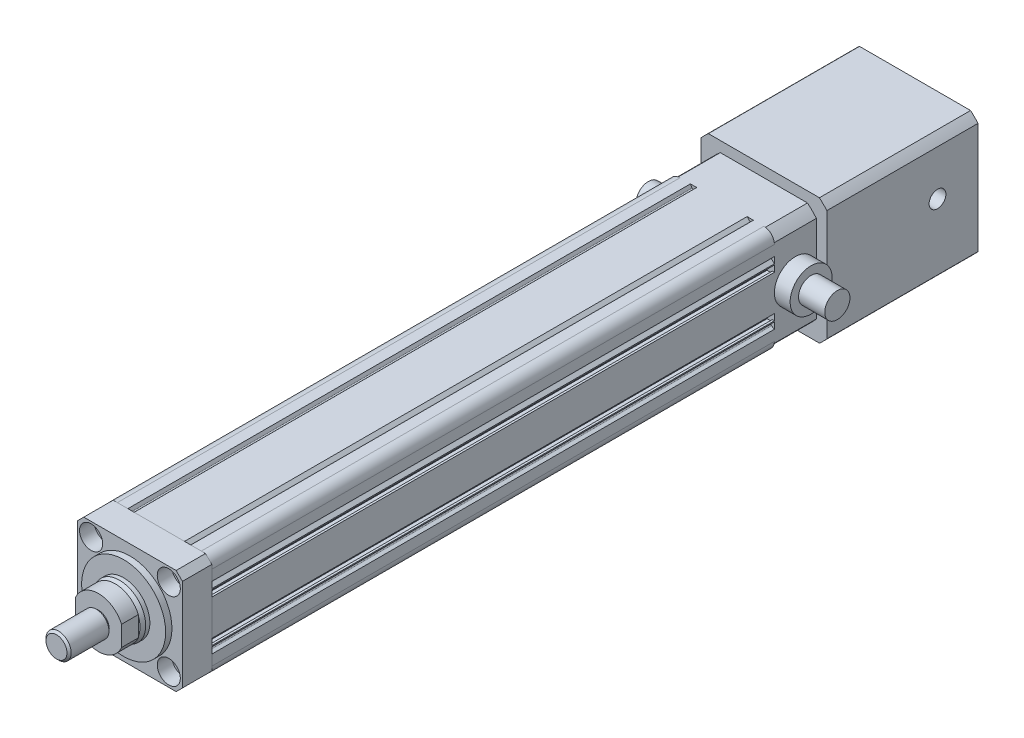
from build123d import *

# Parameters (mm, degrees)
SKETCH_1_R                  = 20
SKETCH_1_R_2                = 2.75
EXTRUDE_1_DEPTH             = 268
FILLET_1_R                  = 5
EXTRUDE_2_DEPTH             = 14
SKETCH_3_R                  = 20
EXTRUDE_3_DEPTH             = 3
SKETCH_5_R                  = 12.5
EXTRUDE_4_DEPTH             = 4
CHAMFER_1_SIZE              = 2
CHAMFER_1_SIZE2             = 0.7
EXTRUDE_5_DEPTH             = 8
SKETCH_7_R                  = 5.15
EXTRUDE_6_DEPTH             = 1
SKETCH_8_R                  = 6
EXTRUDE_7_DEPTH             = 19
CHAMFER_2_SIZE              = 1
SKETCH_23_W                 = 50
SKETCH_23_H                 = 50
EXTRUDE_8_DEPTH             = 20
SKETCH_24_R                 = 42.5
SKETCH_24_R_2               = 32.5
CUT_EXTRUDE_1_DEPTH         = 20
SKETCH_28_W                 = 60
SKETCH_28_H                 = 60
EXTRUDE_9_DEPTH             = 72
SKETCH_4_R                  = 3.5
CUT_EXTRUDE_5_DEPTH         = 30
SKETCH_4_6_R                = 5.5
CUT_EXTRUDE_6_DEPTH         = 7
CUT_EXTRUDE_START           = -72
SKETCH_30_R                 = 3.5
CUT_EXTRUDE_7_DEPTH         = 72
SKETCH_30_4_R               = 5.5
CUT_EXTRUDE_8_DEPTH         = 50
HOLE_WIZARD_M5_1_AT_2_COUNT = 2
HOLE_WIZARD_M5_1_AT_2_PITCH = 49.497474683
HOLE_WIZARD_M5_1_AT_3_COUNT = 2
HOLE_WIZARD_M5_1_AT_3_PITCH = 70
HOLE_WIZARD_M5_1_AT_4_COUNT = 2
HOLE_WIZARD_M5_1_AT_4_PITCH = 49.497474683
SKETCH_33_R                 = 19
CUT_EXTRUDE_9_DEPTH         = 65
SKETCH_33_3_R               = 25
CUT_EXTRUDE_10_DEPTH        = 6.5
SKETCH_34_R                 = 50
SKETCH_34_R_2               = 40
CUT_EXTRUDE_2_DEPTH         = 72
SKETCH_35_R                 = 4
CUT_EXTRUDE_11_DEPTH        = 22
SKETCH_36_R                 = 4
CUT_EXTRUDE_12_DEPTH        = 22
SKETCH_37_R                 = 6
EXTRUDE_10_DEPTH            = 20
EXTRUDE_START               = -70
SKETCH_37_2_R               = 6
EXTRUDE_11_DEPTH            = 20
SKETCH_38_R                 = 10
SKETCH_38_R_2               = 6
EXTRUDE_13_DEPTH            = 7.5
EXTRUDE_START_2             = -50
SKETCH_38_3_R               = 10
SKETCH_38_3_R_2             = 6
EXTRUDE_16_DEPTH            = 7.5


with BuildPart() as part:
    # Sketch 1 → Extrude 1 (new body)
    with BuildSketch(Plane.XY):
        with BuildLine():
            Line((-25, 25), (-15, 25))
            Line((-15, 25), (-14.227730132, 23.662389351))
            ThreePointArc((-14.227730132, 23.662389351), (-13.859980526, 23.416666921), (-13.441164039, 23.558835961))
            Line((-13.441164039, 23.558835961), (-12, 25))
            Line((-12, 25), (12, 25))
            Line((12, 25), (13.441164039, 23.558835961))
            ThreePointArc((13.441164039, 23.558835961), (13.859980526, 23.416666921), (14.227730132, 23.662389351))
            Line((14.227730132, 23.662389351), (15, 25))
            Line((15, 25), (25, 25))
            Line((25, 25), (25, 15))
            Line((25, 15), (23.662389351, 14.227730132))
            ThreePointArc((23.662389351, 14.227730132), (23.416666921, 13.859980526), (23.558835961, 13.441164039))
            Line((23.558835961, 13.441164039), (25, 12))
            Line((25, 12), (25, 11.5))
            Line((25, 11.5), (24, 11.5))
            Line((24, 11.5), (24, 12.4))
            Line((24, 12.4), (21.5, 12.4))
            Line((21.5, 12.4), (21.5, 7.6))
            Line((21.5, 7.6), (24, 7.6))
            Line((24, 7.6), (24, 8.5))
            Line((24, 8.5), (25, 8.5))
            Line((25, 8.5), (25, -8.5))
            Line((25, -8.5), (24, -8.5))
            Line((24, -8.5), (24, -7.6))
            Line((24, -7.6), (21.5, -7.6))
            Line((21.5, -7.6), (21.5, -12.4))
            Line((21.5, -12.4), (24, -12.4))
            Line((24, -12.4), (24, -11.5))
            Line((24, -11.5), (25, -11.5))
            Line((25, -11.5), (25, -12))
            Line((25, -12), (23.558835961, -13.441164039))
            ThreePointArc((23.558835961, -13.441164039), (23.416666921, -13.859980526), (23.662389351, -14.227730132))
            Line((23.662389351, -14.227730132), (25, -15))
            Line((25, -15), (25, -25))
            Line((25, -25), (15, -25))
            Line((15, -25), (14.227730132, -23.662389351))
            ThreePointArc((14.227730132, -23.662389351), (13.859980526, -23.416666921), (13.441164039, -23.558835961))
            Line((13.441164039, -23.558835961), (12, -25))
            Line((12, -25), (11.5, -25))
            Line((11.5, -25), (11.5, -24))
            Line((11.5, -24), (12.4, -24))
            Line((12.4, -24), (12.4, -21.5))
            Line((12.4, -21.5), (7.6, -21.5))
            Line((7.6, -21.5), (7.6, -24))
            Line((7.6, -24), (8.5, -24))
            Line((8.5, -24), (8.5, -25))
            Line((8.5, -25), (-8.5, -25))
            Line((-8.5, -25), (-8.5, -24))
            Line((-8.5, -24), (-7.6, -24))
            Line((-7.6, -24), (-7.6, -21.5))
            Line((-7.6, -21.5), (-12.4, -21.5))
            Line((-12.4, -21.5), (-12.4, -24))
            Line((-12.4, -24), (-11.5, -24))
            Line((-11.5, -24), (-11.5, -25))
            Line((-11.5, -25), (-12, -25))
            Line((-12, -25), (-13.441164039, -23.558835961))
            ThreePointArc((-13.441164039, -23.558835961), (-13.859980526, -23.416666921), (-14.227730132, -23.662389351))
            Line((-14.227730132, -23.662389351), (-15, -25))
            Line((-15, -25), (-25, -25))
            Line((-25, -25), (-25, -15))
            Line((-25, -15), (-23.662389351, -14.227730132))
            ThreePointArc((-23.662389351, -14.227730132), (-23.416666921, -13.859980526), (-23.558835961, -13.441164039))
            Line((-23.558835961, -13.441164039), (-25, -12))
            Line((-25, -12), (-25, -11.5))
            Line((-25, -11.5), (-24, -11.5))
            Line((-24, -11.5), (-24, -12.4))
            Line((-24, -12.4), (-21.5, -12.4))
            Line((-21.5, -12.4), (-21.5, -7.6))
            Line((-21.5, -7.6), (-24, -7.6))
            Line((-24, -7.6), (-24, -8.5))
            Line((-24, -8.5), (-25, -8.5))
            Line((-25, -8.5), (-25, 8.5))
            Line((-25, 8.5), (-24, 8.5))
            Line((-24, 8.5), (-24, 7.6))
            Line((-24, 7.6), (-21.5, 7.6))
            Line((-21.5, 7.6), (-21.5, 12.4))
            Line((-21.5, 12.4), (-24, 12.4))
            Line((-24, 12.4), (-24, 11.5))
            Line((-24, 11.5), (-25, 11.5))
            Line((-25, 11.5), (-25, 12))
            Line((-25, 12), (-23.558835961, 13.441164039))
            ThreePointArc((-23.558835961, 13.441164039), (-23.416666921, 13.859980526), (-23.662389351, 14.227730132))
            Line((-23.662389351, 14.227730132), (-25, 15))
            Line((-25, 15), (-25, 25))
        make_face()
        Circle(SKETCH_1_R, mode=Mode.SUBTRACT)
        with Locations((-18.5, 18.5)):
            Circle(SKETCH_1_R_2, mode=Mode.SUBTRACT)
        with Locations((18.5, 18.5)):
            Circle(SKETCH_1_R_2, mode=Mode.SUBTRACT)
        with Locations((18.5, -18.5)):
            Circle(SKETCH_1_R_2, mode=Mode.SUBTRACT)
        with Locations((-18.5, -18.5)):
            Circle(SKETCH_1_R_2, mode=Mode.SUBTRACT)
        with BuildLine():
            Line((-13.868836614, 23), (-5, 23))
            ThreePointArc((-5, 23), (-4.502985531, 22.554558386), (-4.891534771, 22.01190647))
            ThreePointArc((-4.891534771, 22.01190647), (-10.498377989, 19.955831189), (-15.368836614, 16.5))
            Line((-15.368836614, 16.5), (-15.368836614, 21.5))
            Line((-15.368836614, 21.5), (-13.868836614, 23))
        make_face(mode=Mode.SUBTRACT)
        with BuildLine():
            Line((15.368836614, 16.5), (15.368836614, 21.5))
            Line((15.368836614, 21.5), (13.868836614, 23))
            Line((13.868836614, 23), (5, 23))
            ThreePointArc((5, 23), (4.502985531, 22.554558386), (4.891534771, 22.01190647))
            ThreePointArc((4.891534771, 22.01190647), (10.498377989, 19.955831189), (15.368836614, 16.5))
        make_face(mode=Mode.SUBTRACT)
    extrude(amount=EXTRUDE_1_DEPTH)

    # Fillet 1
    fillet_1_edges = [part.edges().sort_by_distance(p)[0] for p in [
        (-25, 25, 134),
        (25, 25, 134),
        (25, -25, 134),
        (-25, -25, 134),
    ]]
    fillet(fillet_1_edges, radius=FILLET_1_R)

    # Sketch 23 → Extrude 8 (add)
    with BuildSketch(Plane(origin=(0, 0, 0), x_dir=(-1, 0, 0), z_dir=(0, 0, -1))):
        Rectangle(SKETCH_23_W, SKETCH_23_H)
    extrude(amount=EXTRUDE_8_DEPTH)

    # Sketch 24 → Cut-Extrude 1 (cut)
    with BuildSketch(Plane(origin=(0, 0, -20), x_dir=(-1, 0, 0), z_dir=(0, 0, -1))):
        Circle(SKETCH_24_R)
        Circle(SKETCH_24_R_2, mode=Mode.SUBTRACT)
    extrude(amount=-CUT_EXTRUDE_1_DEPTH, mode=Mode.SUBTRACT)

    # Sketch 27 → Hole Wizard M6 _1 (revolve, cut)
    with BuildSketch(Plane(origin=(0, -25, -12), x_dir=(0, 0, -1), z_dir=(1, 0, 0))):
        Polygon((0, 0), (0, 8.502151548), (2.5, 7), (2.5, 0), align=None)
    revolve(axis=Axis((0, -31.35, -12), (0, 1, 0)), mode=Mode.SUBTRACT)


with BuildPart() as body_2:
    # Sketch 2 → Extrude 2 (new body)
    with BuildSketch(Plane.XY.offset(268)):
        Polygon((-25, 22), (-22, 25), (22, 25), (25, 22), (25, -22), (22, -25), (-22, -25), (-25, -22), align=None)
    extrude(amount=EXTRUDE_2_DEPTH)


with BuildPart() as body_3:
    # Sketch 3 → Extrude 3 (new body)
    with BuildSketch(Plane.XY.offset(282)):
        Circle(SKETCH_3_R)
    extrude(amount=EXTRUDE_3_DEPTH)


with BuildPart() as body_4:
    # Sketch 5 → Extrude 4 (new body)
    with BuildSketch(Plane.XY.offset(285)):
        Circle(SKETCH_5_R)
    extrude(amount=EXTRUDE_4_DEPTH)

    # Chamfer 1
    chamfer_1_edges = [body_4.edges().sort_by_distance(p)[0] for p in [
        (-12.5, 0, 289),
    ]]
    chamfer_1_side = [body_4.faces().sort_by_distance(p)[0] for p in [
        (-12.5, 0, 287),
    ]]
    chamfer(chamfer_1_edges, length=CHAMFER_1_SIZE, length2=CHAMFER_1_SIZE2, reference=chamfer_1_side[0])


with BuildPart() as body_5:
    # Sketch 6 → Extrude 5 (new body)
    with BuildSketch(Plane.XY.offset(289)):
        with BuildLine():
            Line((-11, 4.795831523), (-11, -4.795831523))
            ThreePointArc((-11, -4.795831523), (0, -12), (11, -4.795831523))
            Line((11, -4.795831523), (11, 4.795831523))
            ThreePointArc((11, 4.795831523), (0, 12), (-11, 4.795831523))
        make_face()
    extrude(amount=EXTRUDE_5_DEPTH)


with BuildPart() as body_6:
    # Sketch 7 → Extrude 6 (new body)
    with BuildSketch(Plane.XY.offset(297)):
        Circle(SKETCH_7_R)
    extrude(amount=EXTRUDE_6_DEPTH)


with BuildPart() as body_7:
    # Sketch 8 → Extrude 7 (new body)
    with BuildSketch(Plane.XY.offset(298)):
        Circle(SKETCH_8_R)
    extrude(amount=EXTRUDE_7_DEPTH)

    # Chamfer 2
    chamfer_2_edges = [body_7.edges().sort_by_distance(p)[0] for p in [
        (-6, 0, 317),
    ]]
    chamfer(chamfer_2_edges, length=CHAMFER_2_SIZE)


with BuildPart() as body_8:
    # Sketch 28 → Extrude 9 (new body)
    with BuildSketch(Plane(origin=(0, 0, -20), x_dir=(-1, 0, 0), z_dir=(0, 0, -1))):
        Rectangle(SKETCH_28_W, SKETCH_28_H)
    extrude(amount=EXTRUDE_9_DEPTH)

    # Sketch 30 → Cut-Extrude 7 (cut)
    with BuildSketch(Plane(origin=(0, 0, -92), x_dir=(-1, 0, 0), z_dir=(0, 0, -1)).offset(CUT_EXTRUDE_START)):
        with Locations((-16.099900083, 18.5)):
            Circle(SKETCH_30_R)
        with Locations((19.700049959, 17.299950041)):
            Circle(SKETCH_30_R)
        with Locations((18.5, -18.5)):
            Circle(SKETCH_30_R)
        with Locations((-17.299950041, -17.299950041)):
            Circle(SKETCH_30_R)
    extrude(amount=CUT_EXTRUDE_7_DEPTH, mode=Mode.SUBTRACT)

    # Sketch 30_4 → Cut-Extrude 8 (cut)
    with BuildSketch(Plane(origin=(0, 0, -92), x_dir=(-1, 0, 0), z_dir=(0, 0, -1))):
        with Locations((18.5, -18.5)):
            Circle(SKETCH_30_4_R)
        with Locations((-17.299950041, -17.299950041)):
            Circle(SKETCH_30_4_R)
        with Locations((-16.099900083, 18.5)):
            Circle(SKETCH_30_4_R)
        with Locations((19.700049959, 17.299950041)):
            Circle(SKETCH_30_4_R)
    extrude(amount=-CUT_EXTRUDE_8_DEPTH, mode=Mode.SUBTRACT)

    # Sketch 32 → Hole Wizard M5 _1 (revolve, cut)
    with BuildSketch(Plane(origin=(-24.748737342, -24.748737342, -92), x_dir=(0, 1, 0), z_dir=(1, 0, 0))):
        Polygon((0, 0), (0, 15.2618073), (2.1, 14), (2.1, 0), align=None)
    hole_wizard_m5_1 = revolve(axis=Axis((-24.748737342, -24.748737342, -98.35), (0, 0, 1)), mode=Mode.SUBTRACT)

    # Hole Wizard M5 _1 at 2: Hole Wizard M5 _1 ×2
    with Locations(*[(i * HOLE_WIZARD_M5_1_AT_2_PITCH, 0, 0) for i in range(1, HOLE_WIZARD_M5_1_AT_2_COUNT)]):
        add(hole_wizard_m5_1, mode=Mode.SUBTRACT)

    # Hole Wizard M5 _1 at 3: Hole Wizard M5 _1 ×2
    with Locations(*[Vector(0.7071067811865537, 0.7071067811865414, 0) * (i * HOLE_WIZARD_M5_1_AT_3_PITCH) for i in range(1, HOLE_WIZARD_M5_1_AT_3_COUNT)]):
        add(hole_wizard_m5_1, mode=Mode.SUBTRACT)

    # Hole Wizard M5 _1 at 4: Hole Wizard M5 _1 ×2
    with Locations(*[(0, i * HOLE_WIZARD_M5_1_AT_4_PITCH, 0) for i in range(1, HOLE_WIZARD_M5_1_AT_4_COUNT)]):
        add(hole_wizard_m5_1, mode=Mode.SUBTRACT)

    # Sketch 33 → Cut-Extrude 9 (cut)
    with BuildSketch(Plane(origin=(0, 0, -92), x_dir=(-1, 0, 0), z_dir=(0, 0, -1))):
        Circle(SKETCH_33_R)
    extrude(amount=-CUT_EXTRUDE_9_DEPTH, mode=Mode.SUBTRACT)

    # Sketch 33_3 → Cut-Extrude 10 (cut)
    with BuildSketch(Plane(origin=(0, 0, -92), x_dir=(-1, 0, 0), z_dir=(0, 0, -1))):
        Circle(SKETCH_33_3_R)
    extrude(amount=-CUT_EXTRUDE_10_DEPTH, mode=Mode.SUBTRACT)

    # Sketch 34 → Cut-Extrude 2 (cut)
    with BuildSketch(Plane(origin=(0, 0, -92), x_dir=(-1, 0, 0), z_dir=(0, 0, -1))):
        Circle(SKETCH_34_R)
        Circle(SKETCH_34_R_2, mode=Mode.SUBTRACT)
    extrude(amount=-CUT_EXTRUDE_2_DEPTH, mode=Mode.SUBTRACT)

    # Sketch 35 → Cut-Extrude 11 (cut)
    with BuildSketch(Plane(origin=(30, 0, 0), x_dir=(0, 0, -1), z_dir=(1, 0, 0))):
        with Locations((72.713697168, 4.902306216)):
            Circle(SKETCH_35_R)
    extrude(amount=-CUT_EXTRUDE_11_DEPTH, mode=Mode.SUBTRACT)

    # Sketch 36 → Cut-Extrude 12 (cut)
    with BuildSketch(Plane.ZY.offset(30)):
        with Locations((-37.731412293, -10.555978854)):
            Circle(SKETCH_36_R)
    extrude(amount=-CUT_EXTRUDE_12_DEPTH, mode=Mode.SUBTRACT)


with BuildPart() as cut_extrude_5_tool:
    # Sketch 4 → Cut-Extrude 5 (new body)
    with BuildSketch(Plane.XY.offset(282)):
        with Locations((-35, 17.5)):
            Circle(SKETCH_4_R)
        with Locations((-18.5, 18.5)):
            Circle(SKETCH_4_R)
        with Locations(Location((-18.5, -18.5, 0), (0, 0, 180))):
            Circle(SKETCH_4_R)
        with Locations((-35, -17.5)):
            Circle(SKETCH_4_R)
        with Locations((35, -17.5)):
            Circle(SKETCH_4_R)
        with Locations((18.5, -18.5)):
            Circle(SKETCH_4_R)
        with Locations(Location((18.5, 18.5, 0), (0, 0, 180))):
            Circle(SKETCH_4_R)
        with Locations((35, 17.5)):
            Circle(SKETCH_4_R)
    extrude(amount=-CUT_EXTRUDE_5_DEPTH)


with BuildPart() as part_1:
    add(part.part)

    # Cut-Extrude 5: cut by cut_extrude_5_tool
    add(cut_extrude_5_tool.part, mode=Mode.SUBTRACT)

    # Sketch 37 → Extrude 10 (add)
    with BuildSketch(Plane(origin=(25, 0, 0), x_dir=(0, 0, -1), z_dir=(1, 0, 0))):
        with Locations(Location((10, 0, 0), (0, 0, 270))):
            Circle(SKETCH_37_R)
    extrude(amount=EXTRUDE_10_DEPTH)

    # Sketch 37_2 → Extrude 11 (add)
    with BuildSketch(Plane(origin=(25, 0, 0), x_dir=(0, 0, -1), z_dir=(1, 0, 0)).offset(EXTRUDE_START)):
        with Locations(Location((10, 0, 0), (0, 0, 270))):
            Circle(SKETCH_37_2_R)
    extrude(amount=EXTRUDE_11_DEPTH)


with BuildPart() as body_2_1:
    add(body_2.part)

    # Cut-Extrude 5: cut by cut_extrude_5_tool
    add(cut_extrude_5_tool.part, mode=Mode.SUBTRACT)

    # Sketch 4_6 → Cut-Extrude 6 (cut)
    with BuildSketch(Plane.XY.offset(282)):
        with Locations((-18.5, 18.5)):
            Circle(SKETCH_4_6_R)
        with Locations(Location((-18.5, -18.5, 0), (0, 0, 180))):
            Circle(SKETCH_4_6_R)
        with Locations((18.5, -18.5)):
            Circle(SKETCH_4_6_R)
        with Locations(Location((18.5, 18.5, 0), (0, 0, 180))):
            Circle(SKETCH_4_6_R)
    extrude(amount=-CUT_EXTRUDE_6_DEPTH, mode=Mode.SUBTRACT)


with BuildPart() as body_9:
    # Sketch 38 → Extrude 13 (new body)
    with BuildSketch(Plane(origin=(25, 0, 0), x_dir=(0, 0, -1), z_dir=(1, 0, 0))):
        with Locations(Location((10, 0, 0), (0, 0, 90))):
            Circle(SKETCH_38_R)
        with Locations(Location((10, 0, 0), (0, 0, 90))):
            Circle(SKETCH_38_R_2, mode=Mode.SUBTRACT)
    extrude(amount=EXTRUDE_13_DEPTH)


with BuildPart() as body_10:
    # Sketch 38_3 → Extrude 16 (new body)
    with BuildSketch(Plane(origin=(25, 0, 0), x_dir=(0, 0, -1), z_dir=(1, 0, 0)).offset(EXTRUDE_START_2)):
        with Locations(Location((10, 0, 0), (0, 0, 90))):
            Circle(SKETCH_38_3_R)
        with Locations(Location((10, 0, 0), (0, 0, 90))):
            Circle(SKETCH_38_3_R_2, mode=Mode.SUBTRACT)
    extrude(amount=-EXTRUDE_16_DEPTH)


solid = Compound([body_3.part, body_4.part, body_5.part, body_6.part, body_7.part, body_8.part, part_1.part, body_2_1.part, body_9.part, body_10.part])
